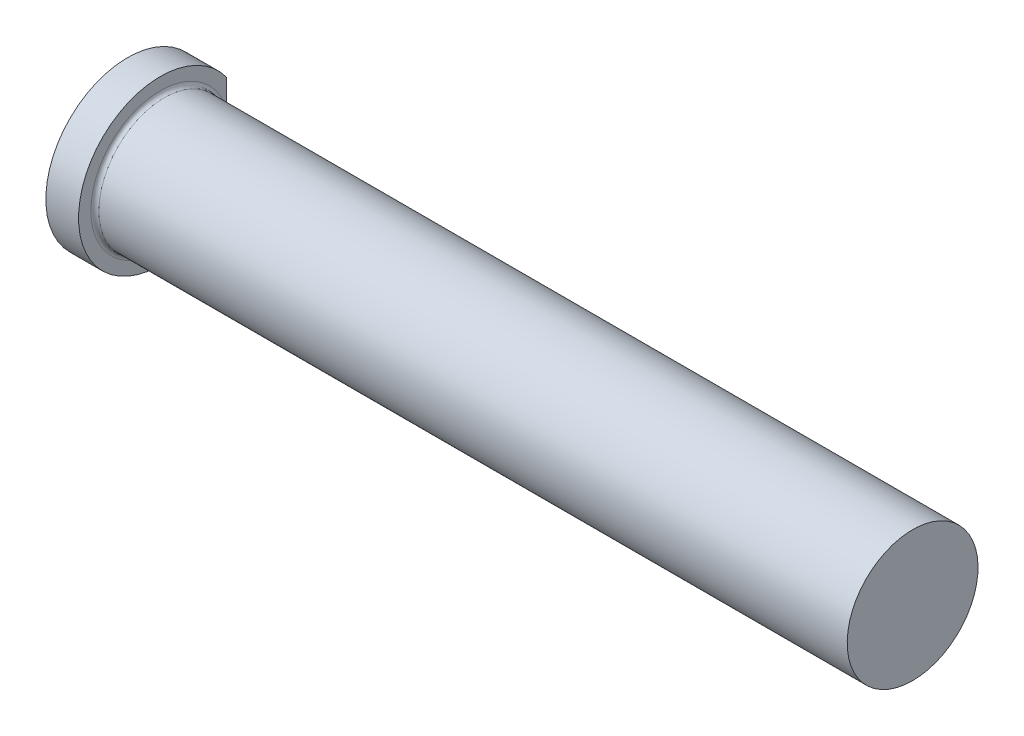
ISO-10303-21;
HEADER;
FILE_DESCRIPTION(('STEP AP214'),'2;1');
FILE_NAME('part.step','',(''),(''),'','','');
FILE_SCHEMA(('AUTOMOTIVE_DESIGN { 1 0 10303 214 1 1 1 1 }'));
ENDSEC;
DATA;
#1=APPLICATION_CONTEXT('core data for automotive mechanical design processes');
#2=APPLICATION_PROTOCOL_DEFINITION('international standard','automotive_design',2000,#1);
#3=PRODUCT_CONTEXT('',#1,'mechanical');
#4=PRODUCT('Part','Part','',(#3));
#5=PRODUCT_RELATED_PRODUCT_CATEGORY('part','',(#4));
#6=PRODUCT_DEFINITION_FORMATION('','',#4);
#7=PRODUCT_DEFINITION_CONTEXT('part definition',#1,'design');
#8=PRODUCT_DEFINITION('design','',#6,#7);
#9=PRODUCT_DEFINITION_SHAPE('','',#8);
#10=(LENGTH_UNIT() NAMED_UNIT(*) SI_UNIT(.MILLI.,.METRE.));
#11=(NAMED_UNIT(*) PLANE_ANGLE_UNIT() SI_UNIT($,.RADIAN.));
#12=(NAMED_UNIT(*) SI_UNIT($,.STERADIAN.) SOLID_ANGLE_UNIT());
#13=UNCERTAINTY_MEASURE_WITH_UNIT(LENGTH_MEASURE(1.E-05),#10,'distance_accuracy_value','');
#14=(GEOMETRIC_REPRESENTATION_CONTEXT(3) GLOBAL_UNCERTAINTY_ASSIGNED_CONTEXT((#13)) GLOBAL_UNIT_ASSIGNED_CONTEXT((#10,
#11,#12)) REPRESENTATION_CONTEXT('',''));
#15=CARTESIAN_POINT('',(0.,0.,0.));
#16=DIRECTION('',(0.,0.,1.));
#17=DIRECTION('',(1.,0.,0.));
#18=AXIS2_PLACEMENT_3D('',#15,#16,#17);
#19=CARTESIAN_POINT('',(0.,0.,0.));
#20=DIRECTION('',(1.,0.,0.));
#21=DIRECTION('',(0.,1.,0.));
#22=AXIS2_PLACEMENT_3D('',#19,#20,#21);
#23=PLANE('',#22);
#24=DIRECTION('',(0.,1.,0.));
#25=VECTOR('',#24,1.);
#26=CARTESIAN_POINT('',(0.,0.,-12.8778));
#27=LINE('',#26,#25);
#28=CARTESIAN_POINT('',(0.,-9.28320484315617,-12.8778));
#29=VERTEX_POINT('',#28);
#30=CARTESIAN_POINT('',(0.,9.28320484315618,-12.8778));
#31=VERTEX_POINT('',#30);
#32=EDGE_CURVE('E49',#29,#31,#27,.T.);
#33=ORIENTED_EDGE('',*,*,#32,.F.);
#34=CARTESIAN_POINT('',(0.,0.,0.));
#35=DIRECTION('',(-1.,0.,0.));
#36=DIRECTION('',(0.,-1.,0.));
#37=AXIS2_PLACEMENT_3D('',#34,#35,#36);
#38=CIRCLE('',#37,15.875);
#39=EDGE_CURVE('E43',#29,#31,#38,.T.);
#40=ORIENTED_EDGE('',*,*,#39,.T.);
#41=EDGE_LOOP('',(#33,#40));
#42=FACE_BOUND('',#41,.T.);
#43=ADVANCED_FACE('F32',(#42),#23,.F.);
#44=CARTESIAN_POINT('',(152.4,0.,0.));
#45=DIRECTION('',(-1.,0.,0.));
#46=DIRECTION('',(0.,-1.,0.));
#47=AXIS2_PLACEMENT_3D('',#44,#45,#46);
#48=CYLINDRICAL_SURFACE('',#47,15.875);
#49=DIRECTION('',(-1.,0.,0.));
#50=VECTOR('',#49,1.);
#51=CARTESIAN_POINT('',(152.4,-9.2832048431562,-12.8778));
#52=LINE('',#51,#50);
#53=CARTESIAN_POINT('',(6.34999999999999,-9.28320484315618,-12.8778));
#54=VERTEX_POINT('',#53);
#55=EDGE_CURVE('E87',#54,#29,#52,.T.);
#56=ORIENTED_EDGE('',*,*,#55,.F.);
#57=CARTESIAN_POINT('',(6.34999999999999,0.,0.));
#58=DIRECTION('',(-1.,0.,0.));
#59=DIRECTION('',(0.,-1.,0.));
#60=AXIS2_PLACEMENT_3D('',#57,#58,#59);
#61=CIRCLE('',#60,15.875);
#62=CARTESIAN_POINT('',(6.35,9.28320484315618,-12.8778));
#63=VERTEX_POINT('',#62);
#64=EDGE_CURVE('E75',#54,#63,#61,.T.);
#65=ORIENTED_EDGE('',*,*,#64,.T.);
#66=DIRECTION('',(-1.,0.,0.));
#67=VECTOR('',#66,1.);
#68=CARTESIAN_POINT('',(152.4,9.28320484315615,-12.8778));
#69=LINE('',#68,#67);
#70=EDGE_CURVE('E56',#31,#63,#69,.F.);
#71=ORIENTED_EDGE('',*,*,#70,.F.);
#72=ORIENTED_EDGE('',*,*,#39,.F.);
#73=EDGE_LOOP('',(#56,#65,#71,#72));
#74=FACE_BOUND('',#73,.T.);
#75=ADVANCED_FACE('F97',(#74),#48,.T.);
#76=CARTESIAN_POINT('',(6.35,15.875,0.));
#77=DIRECTION('',(-1.,0.,0.));
#78=DIRECTION('',(0.,-1.,0.));
#79=AXIS2_PLACEMENT_3D('',#76,#77,#78);
#80=PLANE('',#79);
#81=DIRECTION('',(0.,-1.,0.));
#82=VECTOR('',#81,1.);
#83=CARTESIAN_POINT('',(6.35,15.875,-12.8778));
#84=LINE('',#83,#82);
#85=CARTESIAN_POINT('',(6.35,4.00901807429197,-12.8778));
#86=VERTEX_POINT('',#85);
#87=EDGE_CURVE('E84',#63,#86,#84,.T.);
#88=ORIENTED_EDGE('',*,*,#87,.F.);
#89=ORIENTED_EDGE('',*,*,#64,.F.);
#90=CARTESIAN_POINT('',(6.35,-4.00901807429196,-12.8778));
#91=VERTEX_POINT('',#90);
#92=EDGE_CURVE('E80',#91,#54,#84,.T.);
#93=ORIENTED_EDGE('',*,*,#92,.F.);
#94=CARTESIAN_POINT('',(6.34999999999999,0.,0.));
#95=DIRECTION('',(-1.,0.,0.));
#96=DIRECTION('',(0.,-1.,0.));
#97=AXIS2_PLACEMENT_3D('',#94,#95,#96);
#98=CIRCLE('',#97,13.4874);
#99=EDGE_CURVE('E70',#91,#86,#98,.T.);
#100=ORIENTED_EDGE('',*,*,#99,.T.);
#101=EDGE_LOOP('',(#88,#89,#93,#100));
#102=FACE_BOUND('',#101,.T.);
#103=ADVANCED_FACE('F81',(#102),#80,.F.);
#104=CARTESIAN_POINT('',(7.1374,0.,0.));
#105=DIRECTION('',(-1.,0.,0.));
#106=DIRECTION('',(0.,-1.,0.));
#107=AXIS2_PLACEMENT_3D('',#104,#105,#106);
#108=TOROIDAL_SURFACE('',#107,13.4874,0.787400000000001);
#109=CARTESIAN_POINT('',(7.13739999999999,0.,0.));
#110=DIRECTION('',(-1.,0.,0.));
#111=DIRECTION('',(0.,-1.,0.));
#112=AXIS2_PLACEMENT_3D('',#109,#110,#111);
#113=CIRCLE('',#112,12.7);
#114=CARTESIAN_POINT('',(7.13739999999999,-12.7,0.));
#115=VERTEX_POINT('',#114);
#116=EDGE_CURVE('E76',#115,#115,#113,.T.);
#117=ORIENTED_EDGE('',*,*,#116,.T.);
#118=EDGE_LOOP('',(#117));
#119=FACE_BOUND('',#118,.T.);
#120=CARTESIAN_POINT('',(6.63901601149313,0.,-12.8778));
#121=CARTESIAN_POINT('',(6.63901868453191,-0.131296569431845,-12.8778));
#122=CARTESIAN_POINT('',(6.63652828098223,-0.262591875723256,-12.8778));
#123=CARTESIAN_POINT('',(6.6269545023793,-0.525061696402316,-12.8778));
#124=CARTESIAN_POINT('',(6.61986921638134,-0.656236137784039,-12.8778));
#125=CARTESIAN_POINT('',(6.602053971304,-0.918774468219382,-12.8778));
#126=CARTESIAN_POINT('',(6.59131169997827,-1.05013748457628,-12.8778));
#127=CARTESIAN_POINT('',(6.56744052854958,-1.3126205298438,-12.8778));
#128=CARTESIAN_POINT('',(6.55431195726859,-1.4437405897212,-12.8778));
#129=CARTESIAN_POINT('',(6.51881618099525,-1.78355168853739,-12.8778));
#130=CARTESIAN_POINT('',(6.49558586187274,-1.99214950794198,-12.8778));
#131=CARTESIAN_POINT('',(6.45080593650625,-2.40958691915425,-12.8778));
#132=CARTESIAN_POINT('',(6.42925678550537,-2.61842656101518,-12.8778));
#133=CARTESIAN_POINT('',(6.3919132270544,-3.03621025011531,-12.8778));
#134=CARTESIAN_POINT('',(6.37610628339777,-3.24515306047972,-12.8778));
#135=CARTESIAN_POINT('',(6.3598628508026,-3.5589122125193,-12.8778));
#136=CARTESIAN_POINT('',(6.3556929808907,-3.66352978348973,-12.8778));
#137=CARTESIAN_POINT('',(6.35047389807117,-3.87283880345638,-12.8778));
#138=CARTESIAN_POINT('',(6.34942435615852,-3.97753024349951,-12.8778));
#139=CARTESIAN_POINT('',(6.35119273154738,-4.1875827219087,-12.8778));
#140=CARTESIAN_POINT('',(6.35403628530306,-4.29294360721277,-12.8778));
#141=CARTESIAN_POINT('',(6.3645951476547,-4.50350040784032,-12.8778));
#142=CARTESIAN_POINT('',(6.37231320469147,-4.60869619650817,-12.8778));
#143=CARTESIAN_POINT('',(6.39394813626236,-4.81884639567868,-12.8778));
#144=CARTESIAN_POINT('',(6.40788696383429,-4.9237986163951,-12.8778));
#145=CARTESIAN_POINT('',(6.44380241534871,-5.1322790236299,-12.8778));
#146=CARTESIAN_POINT('',(6.46576843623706,-5.23580890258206,-12.8778));
#147=CARTESIAN_POINT('',(6.50717247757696,-5.38955708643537,-12.8778));
#148=CARTESIAN_POINT('',(6.5225107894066,-5.44087681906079,-12.8778));
#149=CARTESIAN_POINT('',(6.55662506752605,-5.5423485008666,-12.8778));
#150=CARTESIAN_POINT('',(6.57539880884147,-5.59250118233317,-12.8778));
#151=CARTESIAN_POINT('',(6.61703213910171,-5.69064999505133,-12.8778));
#152=CARTESIAN_POINT('',(6.63985910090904,-5.73865977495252,-12.8778));
#153=CARTESIAN_POINT('',(6.69078030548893,-5.83175139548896,-12.8778));
#154=CARTESIAN_POINT('',(6.71885981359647,-5.87684096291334,-12.8778));
#155=CARTESIAN_POINT('',(6.77099316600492,-5.94728112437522,-12.8778));
#156=CARTESIAN_POINT('',(6.79308603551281,-5.97406919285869,-12.8778));
#157=CARTESIAN_POINT('',(6.84076712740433,-6.0243769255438,-12.8778));
#158=CARTESIAN_POINT('',(6.86634979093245,-6.04790167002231,-12.8778));
#159=CARTESIAN_POINT('',(6.91286866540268,-6.08338637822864,-12.8778));
#160=CARTESIAN_POINT('',(6.93278555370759,-6.09667036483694,-12.8778));
#161=CARTESIAN_POINT('',(6.97444723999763,-6.11999802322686,-12.8778));
#162=CARTESIAN_POINT('',(6.99618932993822,-6.13004639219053,-12.8778));
#163=CARTESIAN_POINT('',(7.03738805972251,-6.14465050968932,-12.8778));
#164=CARTESIAN_POINT('',(7.05661577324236,-6.14984508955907,-12.8778));
#165=CARTESIAN_POINT('',(7.09567210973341,-6.15691061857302,-12.8778));
#166=CARTESIAN_POINT('',(7.11550022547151,-6.15878429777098,-12.8778));
#167=CARTESIAN_POINT('',(7.15520798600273,-6.15902497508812,-12.8778));
#168=CARTESIAN_POINT('',(7.17508766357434,-6.15738675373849,-12.8778));
#169=CARTESIAN_POINT('',(7.21427972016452,-6.15075992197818,-12.8778));
#170=CARTESIAN_POINT('',(7.23359165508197,-6.14576875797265,-12.8778));
#171=CARTESIAN_POINT('',(7.27588261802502,-6.13126027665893,-12.8778));
#172=CARTESIAN_POINT('',(7.29857886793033,-6.12092591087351,-12.8778));
#173=CARTESIAN_POINT('',(7.3420040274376,-6.09673926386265,-12.8778));
#174=CARTESIAN_POINT('',(7.3627289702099,-6.08288008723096,-12.8778));
#175=CARTESIAN_POINT('',(7.41326328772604,-6.04405971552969,-12.8778));
#176=CARTESIAN_POINT('',(7.44162884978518,-6.01723759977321,-12.8778));
#177=CARTESIAN_POINT('',(7.49408412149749,-5.95972947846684,-12.8778));
#178=CARTESIAN_POINT('',(7.5181628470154,-5.92903388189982,-12.8778));
#179=CARTESIAN_POINT('',(7.5620943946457,-5.86615221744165,-12.8778));
#180=CARTESIAN_POINT('',(7.58205205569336,-5.83403817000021,-12.8778));
#181=CARTESIAN_POINT('',(7.61920378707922,-5.76823274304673,-12.8778));
#182=CARTESIAN_POINT('',(7.63639515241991,-5.73453986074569,-12.8778));
#183=CARTESIAN_POINT('',(7.66847795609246,-5.6660003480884,-12.8778));
#184=CARTESIAN_POINT('',(7.68336439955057,-5.63115140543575,-12.8778));
#185=CARTESIAN_POINT('',(7.71113553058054,-5.56068981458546,-12.8778));
#186=CARTESIAN_POINT('',(7.72402102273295,-5.5250774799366,-12.8778));
#187=CARTESIAN_POINT('',(7.75376873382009,-5.43629209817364,-12.8778));
#188=CARTESIAN_POINT('',(7.76962754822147,-5.3827833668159,-12.8778));
#189=CARTESIAN_POINT('',(7.798283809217,-5.27494438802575,-12.8778));
#190=CARTESIAN_POINT('',(7.8110797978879,-5.22061376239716,-12.8778));
#191=CARTESIAN_POINT('',(7.84566019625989,-5.05663588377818,-12.8778));
#192=CARTESIAN_POINT('',(7.86358389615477,-4.94617350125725,-12.8778));
#193=CARTESIAN_POINT('',(7.89188970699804,-4.72382228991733,-12.8778));
#194=CARTESIAN_POINT('',(7.90223485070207,-4.61192914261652,-12.8778));
#195=CARTESIAN_POINT('',(7.91696288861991,-4.38792042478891,-12.8778));
#196=CARTESIAN_POINT('',(7.92135373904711,-4.27580535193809,-12.8778));
#197=CARTESIAN_POINT('',(7.92659032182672,-3.99016315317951,-12.8778));
#198=CARTESIAN_POINT('',(7.92418374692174,-3.81658467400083,-12.8778));
#199=CARTESIAN_POINT('',(7.9115674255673,-3.46968753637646,-12.8778));
#200=CARTESIAN_POINT('',(7.90135418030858,-3.29636902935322,-12.8778));
#201=CARTESIAN_POINT('',(7.86277043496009,-2.77608970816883,-12.8778));
#202=CARTESIAN_POINT('',(7.82646880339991,-2.42976829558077,-12.8778));
#203=CARTESIAN_POINT('',(7.77031991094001,-1.91166447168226,-12.8778));
#204=CARTESIAN_POINT('',(7.75138258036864,-1.73972731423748,-12.8778));
#205=CARTESIAN_POINT('',(7.71548486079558,-1.39561114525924,-12.8778));
#206=CARTESIAN_POINT('',(7.69852465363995,-1.22343211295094,-12.8778));
#207=CARTESIAN_POINT('',(7.66950377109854,-0.879256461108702,-12.8778));
#208=CARTESIAN_POINT('',(7.65742579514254,-0.70726139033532,-12.8778));
#209=CARTESIAN_POINT('',(7.64072400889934,-0.362929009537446,-12.8778));
#210=CARTESIAN_POINT('',(7.63609800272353,-0.190591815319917,-12.8778));
#211=CARTESIAN_POINT('',(7.63550165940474,0.154062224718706,-12.8778));
#212=CARTESIAN_POINT('',(7.63952947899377,0.326379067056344,-12.8778));
#213=CARTESIAN_POINT('',(7.65518055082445,0.670686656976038,-12.8778));
#214=CARTESIAN_POINT('',(7.66680598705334,0.842677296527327,-12.8778));
#215=CARTESIAN_POINT('',(7.69512158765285,1.18682031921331,-12.8778));
#216=CARTESIAN_POINT('',(7.71182931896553,1.35897116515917,-12.8778));
#217=CARTESIAN_POINT('',(7.74741771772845,1.70301391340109,-12.8778));
#218=CARTESIAN_POINT('',(7.76629821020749,1.87490583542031,-12.8778));
#219=CARTESIAN_POINT('',(7.82244785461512,2.39207947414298,-12.8778));
#220=CARTESIAN_POINT('',(7.85906873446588,2.73748269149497,-12.8778));
#221=CARTESIAN_POINT('',(7.89874275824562,3.25641886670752,-12.8778));
#222=CARTESIAN_POINT('',(7.90942072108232,3.42932116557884,-12.8778));
#223=CARTESIAN_POINT('',(7.92322313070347,3.77540801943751,-12.8778));
#224=CARTESIAN_POINT('',(7.92635086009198,3.94859241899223,-12.8778));
#225=CARTESIAN_POINT('',(7.92292485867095,4.20849415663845,-12.8778));
#226=CARTESIAN_POINT('',(7.9204212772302,4.29526298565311,-12.8778));
#227=CARTESIAN_POINT('',(7.9121379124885,4.46869837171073,-12.8778));
#228=CARTESIAN_POINT('',(7.90635643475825,4.55536485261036,-12.8778));
#229=CARTESIAN_POINT('',(7.89086060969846,4.72804035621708,-12.8778));
#230=CARTESIAN_POINT('',(7.88116052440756,4.81405062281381,-12.8778));
#231=CARTESIAN_POINT('',(7.85693115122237,4.98536730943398,-12.8778));
#232=CARTESIAN_POINT('',(7.84240452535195,5.07067409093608,-12.8778));
#233=CARTESIAN_POINT('',(7.80939783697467,5.2296579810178,-12.8778));
#234=CARTESIAN_POINT('',(7.79162046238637,5.3034790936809,-12.8778));
#235=CARTESIAN_POINT('',(7.75000458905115,5.44982699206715,-12.8778));
#236=CARTESIAN_POINT('',(7.7261396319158,5.52234660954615,-12.8778));
#237=CARTESIAN_POINT('',(7.68413325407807,5.62933206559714,-12.8778));
#238=CARTESIAN_POINT('',(7.66895543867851,5.66496083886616,-12.8778));
#239=CARTESIAN_POINT('',(7.63615756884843,5.73506673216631,-12.8778));
#240=CARTESIAN_POINT('',(7.61853905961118,5.7695445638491,-12.8778));
#241=CARTESIAN_POINT('',(7.58050590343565,5.8366348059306,-12.8778));
#242=CARTESIAN_POINT('',(7.56011087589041,5.86925821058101,-12.8778));
#243=CARTESIAN_POINT('',(7.51585923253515,5.93203228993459,-12.8778));
#244=CARTESIAN_POINT('',(7.49201053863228,5.96218838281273,-12.8778));
#245=CARTESIAN_POINT('',(7.44929056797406,6.00870743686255,-12.8778));
#246=CARTESIAN_POINT('',(7.43163558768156,6.02618066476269,-12.8778));
#247=CARTESIAN_POINT('',(7.39436401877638,6.05896632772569,-12.8778));
#248=CARTESIAN_POINT('',(7.37474591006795,6.0742770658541,-12.8778));
#249=CARTESIAN_POINT('',(7.3332428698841,6.10207510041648,-12.8778));
#250=CARTESIAN_POINT('',(7.31133509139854,6.11452899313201,-12.8778));
#251=CARTESIAN_POINT('',(7.26564218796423,6.13531504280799,-12.8778));
#252=CARTESIAN_POINT('',(7.24186155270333,6.14365672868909,-12.8778));
#253=CARTESIAN_POINT('',(7.198554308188,6.15393295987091,-12.8778));
#254=CARTESIAN_POINT('',(7.1792695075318,6.15688477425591,-12.8778));
#255=CARTESIAN_POINT('',(7.14047975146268,6.15944963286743,-12.8778));
#256=CARTESIAN_POINT('',(7.12097490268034,6.15906423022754,-12.8778));
#257=CARTESIAN_POINT('',(7.08235360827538,6.15499592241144,-12.8778));
#258=CARTESIAN_POINT('',(7.06323656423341,6.15131856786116,-12.8778));
#259=CARTESIAN_POINT('',(7.02582232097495,6.14100472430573,-12.8778));
#260=CARTESIAN_POINT('',(7.00752579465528,6.13436585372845,-12.8778));
#261=CARTESIAN_POINT('',(6.96477909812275,6.11537492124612,-12.8778));
#262=CARTESIAN_POINT('',(6.94087639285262,6.1017966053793,-12.8778));
#263=CARTESIAN_POINT('',(6.89551781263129,6.07103999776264,-12.8778));
#264=CARTESIAN_POINT('',(6.87406814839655,6.05385286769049,-12.8778));
#265=CARTESIAN_POINT('',(6.82018371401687,6.00483718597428,-12.8778));
#266=CARTESIAN_POINT('',(6.78977665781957,5.97080166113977,-12.8778));
#267=CARTESIAN_POINT('',(6.73417895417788,5.89875679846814,-12.8778));
#268=CARTESIAN_POINT('',(6.7090019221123,5.86073746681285,-12.8778));
#269=CARTESIAN_POINT('',(6.6622834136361,5.7813531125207,-12.8778));
#270=CARTESIAN_POINT('',(6.6408415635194,5.73993036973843,-12.8778));
#271=CARTESIAN_POINT('',(6.60146599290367,5.65542952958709,-12.8778));
#272=CARTESIAN_POINT('',(6.58353602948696,5.61234971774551,-12.8778));
#273=CARTESIAN_POINT('',(6.55054318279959,5.52501533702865,-12.8778));
#274=CARTESIAN_POINT('',(6.53548642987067,5.48075848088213,-12.8778));
#275=CARTESIAN_POINT('',(6.50782630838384,5.39151802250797,-12.8778));
#276=CARTESIAN_POINT('',(6.49522178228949,5.34653477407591,-12.8778));
#277=CARTESIAN_POINT('',(6.46549247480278,5.23021725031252,-12.8778));
#278=CARTESIAN_POINT('',(6.4498926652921,5.15849391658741,-12.8778));
#279=CARTESIAN_POINT('',(6.42280072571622,5.01426261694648,-12.8778));
#280=CARTESIAN_POINT('',(6.41131072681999,4.94175426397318,-12.8778));
#281=CARTESIAN_POINT('',(6.39170845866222,4.79615506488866,-12.8778));
#282=CARTESIAN_POINT('',(6.38360239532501,4.72306339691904,-12.8778));
#283=CARTESIAN_POINT('',(6.37025232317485,4.5766146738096,-12.8778));
#284=CARTESIAN_POINT('',(6.3650088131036,4.50325757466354,-12.8778));
#285=CARTESIAN_POINT('',(6.35287154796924,4.2822879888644,-12.8778));
#286=CARTESIAN_POINT('',(6.34965554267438,4.13447270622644,-12.8778));
#287=CARTESIAN_POINT('',(6.35039963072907,3.83909963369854,-12.8778));
#288=CARTESIAN_POINT('',(6.35435071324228,3.69154175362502,-12.8778));
#289=CARTESIAN_POINT('',(6.36757775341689,3.3956833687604,-12.8778));
#290=CARTESIAN_POINT('',(6.37688940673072,3.24738455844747,-12.8778));
#291=CARTESIAN_POINT('',(6.39927521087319,2.95106711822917,-12.8778));
#292=CARTESIAN_POINT('',(6.41234982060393,2.80304852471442,-12.8778));
#293=CARTESIAN_POINT('',(6.44083421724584,2.50705301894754,-12.8778));
#294=CARTESIAN_POINT('',(6.45624695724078,2.35907639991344,-12.8778));
#295=CARTESIAN_POINT('',(6.48794148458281,2.06321569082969,-12.8778));
#296=CARTESIAN_POINT('',(6.50422329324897,1.91533160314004,-12.8778));
#297=CARTESIAN_POINT('',(6.5359787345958,1.62046407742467,-12.8778));
#298=CARTESIAN_POINT('',(6.55145700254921,1.47348115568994,-12.8778));
#299=CARTESIAN_POINT('',(6.58000599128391,1.1792700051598,-12.8778));
#300=CARTESIAN_POINT('',(6.59307668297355,1.0320417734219,-12.8778));
#301=CARTESIAN_POINT('',(6.61499716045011,0.737456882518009,-12.8778));
#302=CARTESIAN_POINT('',(6.62385267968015,0.590100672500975,-12.8778));
#303=CARTESIAN_POINT('',(6.63586017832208,0.295162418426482,-12.8778));
#304=CARTESIAN_POINT('',(6.6390130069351,0.147580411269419,-12.8778));
#305=CARTESIAN_POINT('',(6.63901601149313,0.,-12.8778));
#306=B_SPLINE_CURVE_WITH_KNOTS('',3,(#120,#121,#122,#123,#124,#125,#126,#127,#128,#129,#130,
#131,#132,#133,#134,#135,#136,#137,#138,#139,#140,#141,#142,#143,#144,#145,#146,#147,#148,#149,
#150,#151,#152,#153,#154,#155,#156,#157,#158,#159,#160,#161,#162,#163,#164,#165,#166,#167,#168,
#169,#170,#171,#172,#173,#174,#175,#176,#177,#178,#179,#180,#181,#182,#183,#184,#185,#186,#187,
#188,#189,#190,#191,#192,#193,#194,#195,#196,#197,#198,#199,#200,#201,#202,#203,#204,#205,#206,
#207,#208,#209,#210,#211,#212,#213,#214,#215,#216,#217,#218,#219,#220,#221,#222,#223,#224,#225,
#226,#227,#228,#229,#230,#231,#232,#233,#234,#235,#236,#237,#238,#239,#240,#241,#242,#243,#244,
#245,#246,#247,#248,#249,#250,#251,#252,#253,#254,#255,#256,#257,#258,#259,#260,#261,#262,#263,
#264,#265,#266,#267,#268,#269,#270,#271,#272,#273,#274,#275,#276,#277,#278,#279,#280,#281,#282,
#283,#284,#285,#286,#287,#288,#289,#290,#291,#292,#293,#294,#295,#296,#297,#298,#299,#300,#301,
#302,#303,#304,#305),.UNSPECIFIED.,.T.,.F.,(4,2,2,2,2,2,2,2,2,2,2,2,2,2,2,2,2,2,2,2,2,2,2,2,2,2,
2,2,2,2,2,2,2,2,2,2,2,2,2,2,2,2,2,2,2,2,2,2,2,2,2,2,2,2,2,2,2,2,2,2,2,2,2,2,2,2,2,2,2,2,2,2,2,2,
2,2,2,2,2,2,2,2,2,2,2,2,2,2,2,2,2,2,4),(0.,0.393866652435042,0.787897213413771,1.18326772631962,
1.57858380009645,2.20824402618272,2.83807417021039,3.46652090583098,3.78058665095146,
4.09461928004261,4.41072982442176,4.72701876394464,5.04443282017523,5.36142911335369,
5.52202708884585,5.68252141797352,5.84177799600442,6.00059434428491,6.10453981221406,
6.20832159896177,6.27991966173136,6.35141331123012,6.41090695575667,6.47035166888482,
6.5298847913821,6.58946330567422,6.66386208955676,6.73840755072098,6.85486546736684,
6.97161761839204,7.08487841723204,7.19824930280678,7.31186252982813,7.42542995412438,
7.59273603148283,7.76012158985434,8.09542713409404,8.43235755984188,8.76883732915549,
9.28934516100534,9.81008641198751,10.8544523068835,11.3734064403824,11.8924082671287,
12.4095544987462,12.926548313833,13.4434320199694,13.9604643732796,14.4793045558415,
14.9981029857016,16.0398568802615,16.5594463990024,17.0788099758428,17.3391766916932,
17.5996781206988,17.8592398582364,18.1186586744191,18.346284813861,18.5749176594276,
18.6910279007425,18.8070649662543,18.9223209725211,19.0373166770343,19.111703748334,
19.1861488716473,19.2614245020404,19.3365248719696,19.394785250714,19.4530185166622,
19.5111537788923,19.5693358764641,19.6513384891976,19.733544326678,19.8696933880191,
20.0061925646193,20.145907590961,20.2857712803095,20.42593012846,20.5660226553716,
20.7860575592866,21.0062063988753,21.2267572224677,21.4473464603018,21.8906220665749,
22.3333407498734,22.7790421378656,23.2247979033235,23.6711214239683,24.1174558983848,
24.5608366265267,25.0042227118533,25.4470039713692,25.8897192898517),.UNSPECIFIED.);
#307=EDGE_CURVE('E12',#86,#91,#306,.T.);
#308=ORIENTED_EDGE('',*,*,#307,.F.);
#309=ORIENTED_EDGE('',*,*,#99,.F.);
#310=EDGE_LOOP('',(#308,#309));
#311=FACE_BOUND('',#310,.T.);
#312=ADVANCED_FACE('F72',(#119,#311),#108,.F.);
#313=CARTESIAN_POINT('',(152.4,0.,0.));
#314=DIRECTION('',(-1.,0.,0.));
#315=DIRECTION('',(0.,-1.,0.));
#316=AXIS2_PLACEMENT_3D('',#313,#314,#315);
#317=CYLINDRICAL_SURFACE('',#316,12.7);
#318=ORIENTED_EDGE('',*,*,#116,.F.);
#319=EDGE_LOOP('',(#318));
#320=FACE_BOUND('',#319,.T.);
#321=CARTESIAN_POINT('',(152.4,0.,0.));
#322=DIRECTION('',(-1.,0.,0.));
#323=DIRECTION('',(0.,-1.,0.));
#324=AXIS2_PLACEMENT_3D('',#321,#322,#323);
#325=CIRCLE('',#324,12.7);
#326=CARTESIAN_POINT('',(152.4,-12.7,0.));
#327=VERTEX_POINT('',#326);
#328=EDGE_CURVE('E92',#327,#327,#325,.T.);
#329=ORIENTED_EDGE('',*,*,#328,.T.);
#330=EDGE_LOOP('',(#329));
#331=FACE_BOUND('',#330,.T.);
#332=ADVANCED_FACE('F107',(#320,#331),#317,.T.);
#333=CARTESIAN_POINT('',(152.4,12.7,0.));
#334=DIRECTION('',(-1.,0.,0.));
#335=DIRECTION('',(0.,-1.,0.));
#336=AXIS2_PLACEMENT_3D('',#333,#334,#335);
#337=PLANE('',#336);
#338=ORIENTED_EDGE('',*,*,#328,.F.);
#339=EDGE_LOOP('',(#338));
#340=FACE_BOUND('',#339,.T.);
#341=ADVANCED_FACE('F111',(#340),#337,.F.);
#342=CARTESIAN_POINT('',(0.,0.,-12.8778));
#343=DIRECTION('',(0.,0.,-1.));
#344=DIRECTION('',(0.,1.,0.));
#345=AXIS2_PLACEMENT_3D('',#342,#343,#344);
#346=PLANE('',#345);
#347=ORIENTED_EDGE('',*,*,#55,.T.);
#348=ORIENTED_EDGE('',*,*,#32,.T.);
#349=ORIENTED_EDGE('',*,*,#70,.T.);
#350=ORIENTED_EDGE('',*,*,#87,.T.);
#351=ORIENTED_EDGE('',*,*,#307,.T.);
#352=ORIENTED_EDGE('',*,*,#92,.T.);
#353=EDGE_LOOP('',(#347,#348,#349,#350,#351,#352));
#354=FACE_BOUND('',#353,.T.);
#355=ADVANCED_FACE('F86',(#354),#346,.T.);
#356=CLOSED_SHELL('',(#43,#75,#103,#312,#332,#341,#355));
#357=MANIFOLD_SOLID_BREP('B2',#356);
#358=ADVANCED_BREP_SHAPE_REPRESENTATION('',(#18,#357),#14);
#359=SHAPE_DEFINITION_REPRESENTATION(#9,#358);
ENDSEC;
END-ISO-10303-21;
